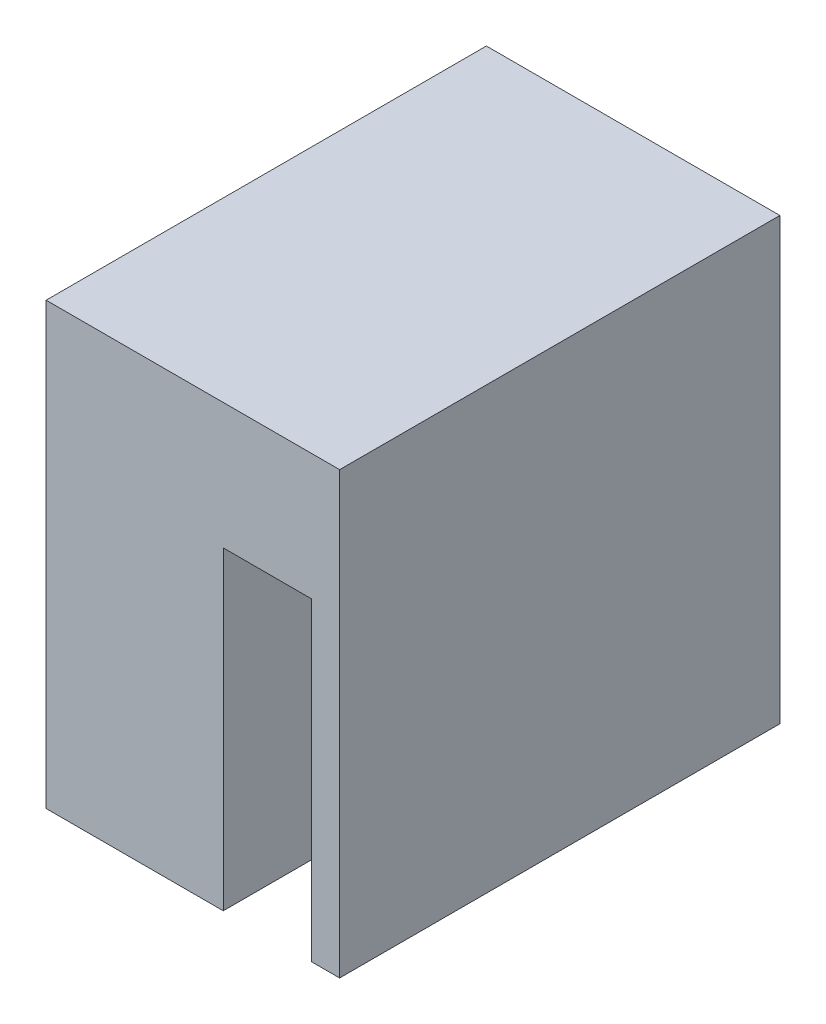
ISO-10303-21;
HEADER;
FILE_DESCRIPTION(('STEP AP214'),'2;1');
FILE_NAME('part.step','',(''),(''),'','','');
FILE_SCHEMA(('AUTOMOTIVE_DESIGN { 1 0 10303 214 1 1 1 1 }'));
ENDSEC;
DATA;
#1=APPLICATION_CONTEXT('core data for automotive mechanical design processes');
#2=APPLICATION_PROTOCOL_DEFINITION('international standard','automotive_design',2000,#1);
#3=PRODUCT_CONTEXT('',#1,'mechanical');
#4=PRODUCT('Part','Part','',(#3));
#5=PRODUCT_RELATED_PRODUCT_CATEGORY('part','',(#4));
#6=PRODUCT_DEFINITION_FORMATION('','',#4);
#7=PRODUCT_DEFINITION_CONTEXT('part definition',#1,'design');
#8=PRODUCT_DEFINITION('design','',#6,#7);
#9=PRODUCT_DEFINITION_SHAPE('','',#8);
#10=(LENGTH_UNIT() NAMED_UNIT(*) SI_UNIT(.MILLI.,.METRE.));
#11=(NAMED_UNIT(*) PLANE_ANGLE_UNIT() SI_UNIT($,.RADIAN.));
#12=(NAMED_UNIT(*) SI_UNIT($,.STERADIAN.) SOLID_ANGLE_UNIT());
#13=UNCERTAINTY_MEASURE_WITH_UNIT(LENGTH_MEASURE(1.E-05),#10,'distance_accuracy_value','');
#14=(GEOMETRIC_REPRESENTATION_CONTEXT(3) GLOBAL_UNCERTAINTY_ASSIGNED_CONTEXT((#13)) GLOBAL_UNIT_ASSIGNED_CONTEXT((#10,
#11,#12)) REPRESENTATION_CONTEXT('',''));
#15=CARTESIAN_POINT('',(0.,0.,0.));
#16=DIRECTION('',(0.,0.,1.));
#17=DIRECTION('',(1.,0.,0.));
#18=AXIS2_PLACEMENT_3D('',#15,#16,#17);
#19=CARTESIAN_POINT('',(0.,10.7088885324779,-15.));
#20=DIRECTION('',(0.,-1.,0.));
#21=DIRECTION('',(0.,0.,-1.));
#22=AXIS2_PLACEMENT_3D('',#19,#20,#21);
#23=PLANE('',#22);
#24=DIRECTION('',(1.,0.,0.));
#25=VECTOR('',#24,1.);
#26=CARTESIAN_POINT('',(0.,10.7088885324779,0.));
#27=LINE('',#26,#25);
#28=CARTESIAN_POINT('',(6.03538732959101,10.7088885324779,0.));
#29=VERTEX_POINT('',#28);
#30=CARTESIAN_POINT('',(9.03538732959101,10.7088885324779,0.));
#31=VERTEX_POINT('',#30);
#32=EDGE_CURVE('E144',#29,#31,#27,.T.);
#33=ORIENTED_EDGE('',*,*,#32,.F.);
#34=DIRECTION('',(0.,0.,1.));
#35=VECTOR('',#34,1.);
#36=CARTESIAN_POINT('',(6.03538732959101,10.7088885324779,-15.));
#37=LINE('',#36,#35);
#38=CARTESIAN_POINT('',(6.03538732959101,10.7088885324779,-15.));
#39=VERTEX_POINT('',#38);
#40=EDGE_CURVE('E11',#39,#29,#37,.T.);
#41=ORIENTED_EDGE('',*,*,#40,.F.);
#42=DIRECTION('',(1.,0.,0.));
#43=VECTOR('',#42,1.);
#44=CARTESIAN_POINT('',(0.,10.7088885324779,-15.));
#45=LINE('',#44,#43);
#46=CARTESIAN_POINT('',(9.03538732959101,10.7088885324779,-15.));
#47=VERTEX_POINT('',#46);
#48=EDGE_CURVE('E135',#39,#47,#45,.T.);
#49=ORIENTED_EDGE('',*,*,#48,.T.);
#50=DIRECTION('',(0.,0.,1.));
#51=VECTOR('',#50,1.);
#52=CARTESIAN_POINT('',(9.03538732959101,10.7088885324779,-15.));
#53=LINE('',#52,#51);
#54=EDGE_CURVE('E36',#47,#31,#53,.T.);
#55=ORIENTED_EDGE('',*,*,#54,.T.);
#56=EDGE_LOOP('',(#33,#41,#49,#55));
#57=FACE_BOUND('',#56,.T.);
#58=ADVANCED_FACE('F33',(#57),#23,.T.);
#59=CARTESIAN_POINT('',(6.03538732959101,0.,-15.));
#60=DIRECTION('',(-1.,0.,0.));
#61=DIRECTION('',(0.,0.,1.));
#62=AXIS2_PLACEMENT_3D('',#59,#60,#61);
#63=PLANE('',#62);
#64=DIRECTION('',(0.,-1.,0.));
#65=VECTOR('',#64,1.);
#66=CARTESIAN_POINT('',(6.03538732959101,0.,0.));
#67=LINE('',#66,#65);
#68=CARTESIAN_POINT('',(6.03538732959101,0.,0.));
#69=VERTEX_POINT('',#68);
#70=EDGE_CURVE('E136',#29,#69,#67,.T.);
#71=ORIENTED_EDGE('',*,*,#70,.T.);
#72=DIRECTION('',(0.,0.,1.));
#73=VECTOR('',#72,1.);
#74=CARTESIAN_POINT('',(6.03538732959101,0.,-15.));
#75=LINE('',#74,#73);
#76=CARTESIAN_POINT('',(6.03538732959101,0.,-15.));
#77=VERTEX_POINT('',#76);
#78=EDGE_CURVE('E42',#77,#69,#75,.T.);
#79=ORIENTED_EDGE('',*,*,#78,.F.);
#80=DIRECTION('',(0.,-1.,0.));
#81=VECTOR('',#80,1.);
#82=CARTESIAN_POINT('',(6.03538732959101,0.,-15.));
#83=LINE('',#82,#81);
#84=EDGE_CURVE('E123',#39,#77,#83,.T.);
#85=ORIENTED_EDGE('',*,*,#84,.F.);
#86=ORIENTED_EDGE('',*,*,#40,.T.);
#87=EDGE_LOOP('',(#71,#79,#85,#86));
#88=FACE_BOUND('',#87,.T.);
#89=ADVANCED_FACE('F184',(#88),#63,.F.);
#90=CARTESIAN_POINT('',(0.,0.,-15.));
#91=DIRECTION('',(0.,-1.,0.));
#92=DIRECTION('',(0.,0.,-1.));
#93=AXIS2_PLACEMENT_3D('',#90,#91,#92);
#94=PLANE('',#93);
#95=DIRECTION('',(1.,0.,0.));
#96=VECTOR('',#95,1.);
#97=CARTESIAN_POINT('',(0.,0.,0.));
#98=LINE('',#97,#96);
#99=CARTESIAN_POINT('',(0.,0.,0.));
#100=VERTEX_POINT('',#99);
#101=EDGE_CURVE('E108',#100,#69,#98,.T.);
#102=ORIENTED_EDGE('',*,*,#101,.F.);
#103=DIRECTION('',(0.,0.,1.));
#104=VECTOR('',#103,1.);
#105=CARTESIAN_POINT('',(0.,0.,-15.));
#106=LINE('',#105,#104);
#107=CARTESIAN_POINT('',(0.,0.,-15.));
#108=VERTEX_POINT('',#107);
#109=EDGE_CURVE('E102',#108,#100,#106,.T.);
#110=ORIENTED_EDGE('',*,*,#109,.F.);
#111=DIRECTION('',(1.,0.,0.));
#112=VECTOR('',#111,1.);
#113=CARTESIAN_POINT('',(0.,0.,-15.));
#114=LINE('',#113,#112);
#115=EDGE_CURVE('E106',#108,#77,#114,.T.);
#116=ORIENTED_EDGE('',*,*,#115,.T.);
#117=ORIENTED_EDGE('',*,*,#78,.T.);
#118=EDGE_LOOP('',(#102,#110,#116,#117));
#119=FACE_BOUND('',#118,.T.);
#120=ADVANCED_FACE('F104',(#119),#94,.T.);
#121=CARTESIAN_POINT('',(0.,0.,-15.));
#122=DIRECTION('',(1.,0.,0.));
#123=DIRECTION('',(0.,0.,-1.));
#124=AXIS2_PLACEMENT_3D('',#121,#122,#123);
#125=PLANE('',#124);
#126=CARTESIAN_POINT('',(0.,7.5,-7.5));
#127=DIRECTION('',(-1.,0.,0.));
#128=DIRECTION('',(0.,0.,1.));
#129=AXIS2_PLACEMENT_3D('',#126,#127,#128);
#130=CIRCLE('',#129,5.00694813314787);
#131=CARTESIAN_POINT('',(0.,7.5,-2.49305186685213));
#132=VERTEX_POINT('',#131);
#133=EDGE_CURVE('E139',#132,#132,#130,.T.);
#134=ORIENTED_EDGE('',*,*,#133,.F.);
#135=EDGE_LOOP('',(#134));
#136=FACE_BOUND('',#135,.T.);
#137=DIRECTION('',(0.,1.,0.));
#138=VECTOR('',#137,1.);
#139=CARTESIAN_POINT('',(0.,0.,0.));
#140=LINE('',#139,#138);
#141=CARTESIAN_POINT('',(0.,15.,0.));
#142=VERTEX_POINT('',#141);
#143=EDGE_CURVE('E163',#100,#142,#140,.T.);
#144=ORIENTED_EDGE('',*,*,#143,.T.);
#145=DIRECTION('',(0.,0.,1.));
#146=VECTOR('',#145,1.);
#147=CARTESIAN_POINT('',(0.,15.,-15.));
#148=LINE('',#147,#146);
#149=CARTESIAN_POINT('',(0.,15.,-15.));
#150=VERTEX_POINT('',#149);
#151=EDGE_CURVE('E111',#150,#142,#148,.T.);
#152=ORIENTED_EDGE('',*,*,#151,.F.);
#153=DIRECTION('',(0.,1.,0.));
#154=VECTOR('',#153,1.);
#155=CARTESIAN_POINT('',(0.,0.,-15.));
#156=LINE('',#155,#154);
#157=EDGE_CURVE('E114',#108,#150,#156,.T.);
#158=ORIENTED_EDGE('',*,*,#157,.F.);
#159=ORIENTED_EDGE('',*,*,#109,.T.);
#160=EDGE_LOOP('',(#144,#152,#158,#159));
#161=FACE_BOUND('',#160,.T.);
#162=ADVANCED_FACE('F115',(#136,#161),#125,.F.);
#163=CARTESIAN_POINT('',(0.,15.,-15.));
#164=DIRECTION('',(0.,-1.,0.));
#165=DIRECTION('',(0.,0.,-1.));
#166=AXIS2_PLACEMENT_3D('',#163,#164,#165);
#167=PLANE('',#166);
#168=DIRECTION('',(1.,0.,0.));
#169=VECTOR('',#168,1.);
#170=CARTESIAN_POINT('',(0.,15.,0.));
#171=LINE('',#170,#169);
#172=CARTESIAN_POINT('',(10.,15.,0.));
#173=VERTEX_POINT('',#172);
#174=EDGE_CURVE('E160',#142,#173,#171,.T.);
#175=ORIENTED_EDGE('',*,*,#174,.T.);
#176=DIRECTION('',(0.,0.,1.));
#177=VECTOR('',#176,1.);
#178=CARTESIAN_POINT('',(10.,15.,-15.));
#179=LINE('',#178,#177);
#180=CARTESIAN_POINT('',(10.,15.,-15.));
#181=VERTEX_POINT('',#180);
#182=EDGE_CURVE('E168',#181,#173,#179,.T.);
#183=ORIENTED_EDGE('',*,*,#182,.F.);
#184=DIRECTION('',(1.,0.,0.));
#185=VECTOR('',#184,1.);
#186=CARTESIAN_POINT('',(0.,15.,-15.));
#187=LINE('',#186,#185);
#188=EDGE_CURVE('E119',#150,#181,#187,.T.);
#189=ORIENTED_EDGE('',*,*,#188,.F.);
#190=ORIENTED_EDGE('',*,*,#151,.T.);
#191=EDGE_LOOP('',(#175,#183,#189,#190));
#192=FACE_BOUND('',#191,.T.);
#193=ADVANCED_FACE('F183',(#192),#167,.F.);
#194=CARTESIAN_POINT('',(10.,0.,-15.));
#195=DIRECTION('',(1.,0.,0.));
#196=DIRECTION('',(0.,0.,-1.));
#197=AXIS2_PLACEMENT_3D('',#194,#195,#196);
#198=PLANE('',#197);
#199=DIRECTION('',(0.,1.,0.));
#200=VECTOR('',#199,1.);
#201=CARTESIAN_POINT('',(10.,0.,0.));
#202=LINE('',#201,#200);
#203=CARTESIAN_POINT('',(10.,0.,0.));
#204=VERTEX_POINT('',#203);
#205=EDGE_CURVE('E157',#204,#173,#202,.T.);
#206=ORIENTED_EDGE('',*,*,#205,.F.);
#207=DIRECTION('',(0.,0.,1.));
#208=VECTOR('',#207,1.);
#209=CARTESIAN_POINT('',(10.,0.,-15.));
#210=LINE('',#209,#208);
#211=CARTESIAN_POINT('',(10.,0.,-15.));
#212=VERTEX_POINT('',#211);
#213=EDGE_CURVE('E170',#212,#204,#210,.T.);
#214=ORIENTED_EDGE('',*,*,#213,.F.);
#215=DIRECTION('',(0.,1.,0.));
#216=VECTOR('',#215,1.);
#217=CARTESIAN_POINT('',(10.,0.,-15.));
#218=LINE('',#217,#216);
#219=EDGE_CURVE('E130',#212,#181,#218,.T.);
#220=ORIENTED_EDGE('',*,*,#219,.T.);
#221=ORIENTED_EDGE('',*,*,#182,.T.);
#222=EDGE_LOOP('',(#206,#214,#220,#221));
#223=FACE_BOUND('',#222,.T.);
#224=ADVANCED_FACE('F180',(#223),#198,.T.);
#225=CARTESIAN_POINT('',(9.03538732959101,0.,0.));
#226=VERTEX_POINT('',#225);
#227=EDGE_CURVE('E152',#226,#204,#98,.T.);
#228=ORIENTED_EDGE('',*,*,#227,.F.);
#229=DIRECTION('',(0.,0.,1.));
#230=VECTOR('',#229,1.);
#231=CARTESIAN_POINT('',(9.03538732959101,0.,-15.));
#232=LINE('',#231,#230);
#233=CARTESIAN_POINT('',(9.03538732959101,0.,-15.));
#234=VERTEX_POINT('',#233);
#235=EDGE_CURVE('E171',#234,#226,#232,.T.);
#236=ORIENTED_EDGE('',*,*,#235,.F.);
#237=EDGE_CURVE('E125',#234,#212,#114,.T.);
#238=ORIENTED_EDGE('',*,*,#237,.T.);
#239=ORIENTED_EDGE('',*,*,#213,.T.);
#240=EDGE_LOOP('',(#228,#236,#238,#239));
#241=FACE_BOUND('',#240,.T.);
#242=ADVANCED_FACE('F177',(#241),#94,.T.);
#243=CARTESIAN_POINT('',(9.03538732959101,0.,-15.));
#244=DIRECTION('',(-1.,0.,0.));
#245=DIRECTION('',(0.,-1.,0.));
#246=AXIS2_PLACEMENT_3D('',#243,#244,#245);
#247=PLANE('',#246);
#248=DIRECTION('',(0.,-1.,0.));
#249=VECTOR('',#248,1.);
#250=CARTESIAN_POINT('',(9.03538732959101,0.,0.));
#251=LINE('',#250,#249);
#252=EDGE_CURVE('E148',#31,#226,#251,.T.);
#253=ORIENTED_EDGE('',*,*,#252,.F.);
#254=ORIENTED_EDGE('',*,*,#54,.F.);
#255=DIRECTION('',(0.,-1.,0.));
#256=VECTOR('',#255,1.);
#257=CARTESIAN_POINT('',(9.03538732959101,0.,-15.));
#258=LINE('',#257,#256);
#259=EDGE_CURVE('E131',#47,#234,#258,.T.);
#260=ORIENTED_EDGE('',*,*,#259,.T.);
#261=ORIENTED_EDGE('',*,*,#235,.T.);
#262=EDGE_LOOP('',(#253,#254,#260,#261));
#263=FACE_BOUND('',#262,.T.);
#264=ADVANCED_FACE('F173',(#263),#247,.T.);
#265=CARTESIAN_POINT('',(0.,0.,-15.));
#266=DIRECTION('',(0.,0.,1.));
#267=DIRECTION('',(1.,0.,0.));
#268=AXIS2_PLACEMENT_3D('',#265,#266,#267);
#269=PLANE('',#268);
#270=ORIENTED_EDGE('',*,*,#48,.F.);
#271=ORIENTED_EDGE('',*,*,#84,.T.);
#272=ORIENTED_EDGE('',*,*,#115,.F.);
#273=ORIENTED_EDGE('',*,*,#157,.T.);
#274=ORIENTED_EDGE('',*,*,#188,.T.);
#275=ORIENTED_EDGE('',*,*,#219,.F.);
#276=ORIENTED_EDGE('',*,*,#237,.F.);
#277=ORIENTED_EDGE('',*,*,#259,.F.);
#278=EDGE_LOOP('',(#270,#271,#272,#273,#274,#275,#276,#277));
#279=FACE_BOUND('',#278,.T.);
#280=ADVANCED_FACE('F122',(#279),#269,.F.);
#281=CARTESIAN_POINT('',(0.,0.,0.));
#282=DIRECTION('',(0.,0.,1.));
#283=DIRECTION('',(1.,0.,0.));
#284=AXIS2_PLACEMENT_3D('',#281,#282,#283);
#285=PLANE('',#284);
#286=ORIENTED_EDGE('',*,*,#32,.T.);
#287=ORIENTED_EDGE('',*,*,#252,.T.);
#288=ORIENTED_EDGE('',*,*,#227,.T.);
#289=ORIENTED_EDGE('',*,*,#205,.T.);
#290=ORIENTED_EDGE('',*,*,#174,.F.);
#291=ORIENTED_EDGE('',*,*,#143,.F.);
#292=ORIENTED_EDGE('',*,*,#101,.T.);
#293=ORIENTED_EDGE('',*,*,#70,.F.);
#294=EDGE_LOOP('',(#286,#287,#288,#289,#290,#291,#292,#293));
#295=FACE_BOUND('',#294,.T.);
#296=ADVANCED_FACE('F174',(#295),#285,.T.);
#297=CARTESIAN_POINT('',(3.,7.5,-7.5));
#298=DIRECTION('',(-1.,0.,0.));
#299=DIRECTION('',(0.,0.,1.));
#300=AXIS2_PLACEMENT_3D('',#297,#298,#299);
#301=CYLINDRICAL_SURFACE('',#300,5.00694813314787);
#302=CARTESIAN_POINT('',(3.,7.5,-7.5));
#303=DIRECTION('',(-1.,0.,0.));
#304=DIRECTION('',(0.,0.,1.));
#305=AXIS2_PLACEMENT_3D('',#302,#303,#304);
#306=CIRCLE('',#305,5.00694813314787);
#307=CARTESIAN_POINT('',(3.,7.5,-2.49305186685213));
#308=VERTEX_POINT('',#307);
#309=EDGE_CURVE('E142',#308,#308,#306,.T.);
#310=ORIENTED_EDGE('',*,*,#309,.F.);
#311=EDGE_LOOP('',(#310));
#312=FACE_BOUND('',#311,.T.);
#313=ORIENTED_EDGE('',*,*,#133,.T.);
#314=EDGE_LOOP('',(#313));
#315=FACE_BOUND('',#314,.T.);
#316=ADVANCED_FACE('F263',(#312,#315),#301,.F.);
#317=CARTESIAN_POINT('',(3.,7.5,-7.5));
#318=DIRECTION('',(-1.,0.,0.));
#319=DIRECTION('',(0.,0.,1.));
#320=AXIS2_PLACEMENT_3D('',#317,#318,#319);
#321=PLANE('',#320);
#322=ORIENTED_EDGE('',*,*,#309,.T.);
#323=EDGE_LOOP('',(#322));
#324=FACE_BOUND('',#323,.T.);
#325=ADVANCED_FACE('F269',(#324),#321,.T.);
#326=CLOSED_SHELL('',(#58,#89,#120,#162,#193,#224,#242,#264,#280,#296,#316,#325));
#327=MANIFOLD_SOLID_BREP('B2',#326);
#328=ADVANCED_BREP_SHAPE_REPRESENTATION('',(#18,#327),#14);
#329=SHAPE_DEFINITION_REPRESENTATION(#9,#328);
ENDSEC;
END-ISO-10303-21;
